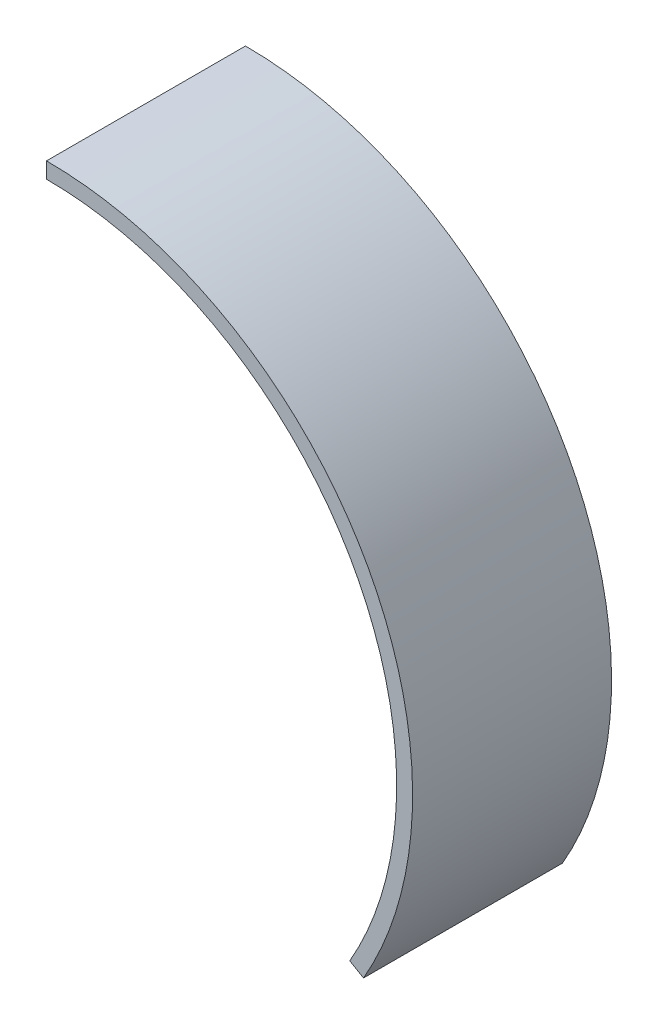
from build123d import *

# Parameters (mm, degrees)
EXTRUSION1_DEPTH = 25
ESQUISSE3_R      = 3.3
EXTRUSION2_DEPTH = 5


with BuildPart() as part:
    # Esquisse1 → Extrusion1 (new body)
    with BuildSketch(Plane.XY):
        with BuildLine():
            Line((0, 46), (0, 44))
            ThreePointArc((0, 44), (38.105117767, 22), (38.105117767, -22))
            Line((38.105117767, -22), (39.837168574, -23))
            ThreePointArc((39.837168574, -23), (39.837168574, 23), (0, 46))
        make_face()
    extrude(amount=EXTRUSION1_DEPTH)

    # Esquisse3 → Extrusion2 (add)
    with BuildSketch(Plane(origin=(39.404155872, 22.75, 0), x_dir=(0, 0, 1), z_dir=(-0.866025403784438, -0.5000000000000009, 0))):
        with Locations(Location((12.500000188, 0.002168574, 0), (0, 0, 90))):
            Circle(ESQUISSE3_R)
    extrude(amount=EXTRUSION2_DEPTH)


solid = part.part
